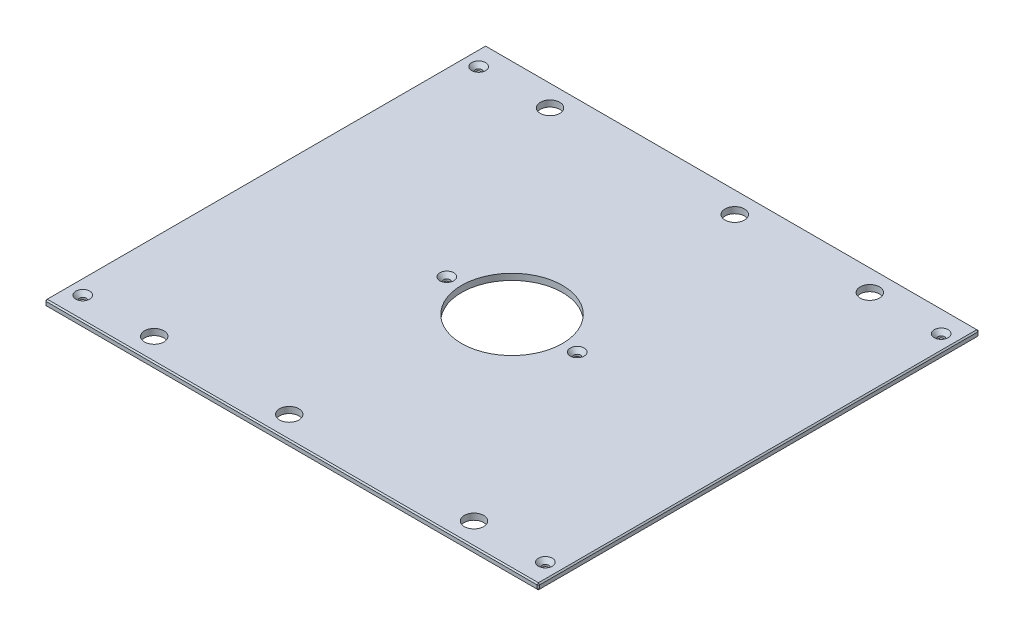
from build123d import *

# Parameters (mm, degrees)
SKETCH1_W                                     = 504.825
SKETCH1_H                                     = 450.85
BOSS_EXTRUDE1_DEPTH                           = 6.35
SKETCH13_R                                    = 51.562
CUT_EXTRUDE6_DEPTH                            = 339.480166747
F_25_32_0_78125_DIAMETER_HOLE1_D              = 19.84375
CHAMFER2_SIZE                                 = 1.27
CSK_FOR_1_4_FLAT_HEAD_MACHINE_SCREW1_AT_COUNT = 2
CSK_FOR_1_4_FLAT_HEAD_MACHINE_SCREW1_AT_PITCH = 404.80996
CSK_FOR_1_4_FLAT_HEAD_MACHINE_SCREW1_2_COUNT  = 2
CSK_FOR_1_4_FLAT_HEAD_MACHINE_SCREW1_2_PITCH  = 622.632362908
CSK_FOR_1_4_FLAT_HEAD_MACHINE_SCREW1_3_COUNT  = 2
CSK_FOR_1_4_FLAT_HEAD_MACHINE_SCREW1_3_PITCH  = 364.562197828
CSK_FOR_1_4_FLAT_HEAD_MACHINE_SCREW1_4_COUNT  = 2
CSK_FOR_1_4_FLAT_HEAD_MACHINE_SCREW1_4_PITCH  = 264.236721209
CSK_FOR_1_4_FLAT_HEAD_MACHINE_SCREW1_5_COUNT  = 2
CSK_FOR_1_4_FLAT_HEAD_MACHINE_SCREW1_5_PITCH  = 473.075
CSK_FOR_1_4_FLAT_HEAD_MACHINE_SCREW1_6_COUNT  = 2
CSK_FOR_1_4_FLAT_HEAD_MACHINE_SCREW1_6_PITCH  = 400.05
CSK_FOR_1_4_FLAT_HEAD_MACHINE_SCREW1_7_COUNT  = 2
CSK_FOR_1_4_FLAT_HEAD_MACHINE_SCREW1_7_PITCH  = 569.131888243


with BuildPart() as part:
    # Sketch1 → Boss-Extrude1 (new body)
    with BuildSketch(Plane(origin=(0, 0, 0), x_dir=(1, 0, 0), z_dir=(0, 1, 0))):
        Rectangle(SKETCH1_W, SKETCH1_H)
    extrude(amount=BOSS_EXTRUDE1_DEPTH)

    # Sketch13 → Cut-Extrude6 (cut, through all)
    with BuildSketch(Plane(origin=(0, 6.35, 0), x_dir=(1, 0, 0), z_dir=(0, 1, 0))):
        with Locations(Location((0, 0, 0), (0, 0, 270))):
            Circle(SKETCH13_R)
    extrude(amount=-CUT_EXTRUDE6_DEPTH, mode=Mode.SUBTRACT)

    # 25_32 _0.78125_ Diameter Hole1 (through all)
    with Locations(Plane(origin=(0, 6.35, 0), x_dir=(1, 0, 0), z_dir=(0, 1, 0))):
        with Locations((163.5125, 202.40498), (-163.5125, 202.40498), (163.5125, -202.40498), (-163.5125, -202.40498), (25.4, 202.40498), (-25.4, -202.40498)):
            Hole(F_25_32_0_78125_DIAMETER_HOLE1_D / 2)

    # Chamfer2
    chamfer2_edges = [part.edges().sort_by_distance(p)[0] for p in [
        (252.4125, 6.35, 0),
        (0, 6.35, -225.425),
        (-252.4125, 6.35, 0),
        (0, 0, -225.425),
        (252.4125, 0, 0),
        (0, 0, 225.425),
        (-252.4125, 0, 0),
        (0, 6.35, 225.425),
        (-252.4125, 3.175, -225.425),
        (252.4125, 3.175, -225.425),
        (252.4125, 3.175, 225.425),
        (-252.4125, 3.175, 225.425),
    ]]
    chamfer(chamfer2_edges, length=CHAMFER2_SIZE)

    # Sketch24 → CSK for 1_4 Flat Head Machine Screw1 (revolve, cut)
    with BuildSketch(Plane(origin=(236.5375, 6.35, -202.40498), x_dir=(0, 0, 1), z_dir=(1, 0, 0))):
        Polygon((0, 0), (0, 6.35), (3.3782, 6.35), (3.3782, 4.324464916), (7.1374, 0), align=None)
    csk_for_1_4_flat_head_machine_screw1 = revolve(axis=Axis((236.5375, 12.7, -202.40498), (0, -1, 0)), mode=Mode.SUBTRACT)

    # CSK for 1_4 Flat Head Machine Screw1 at: CSK for 1_4 Flat Head Machine Screw1 ×2
    with Locations(*[(0, 0, i * CSK_FOR_1_4_FLAT_HEAD_MACHINE_SCREW1_AT_PITCH) for i in range(1, CSK_FOR_1_4_FLAT_HEAD_MACHINE_SCREW1_AT_COUNT)]):
        add(csk_for_1_4_flat_head_machine_screw1, mode=Mode.SUBTRACT)

    # CSK for 1_4 Flat Head Machine Screw1 2: CSK for 1_4 Flat Head Machine Screw1 ×2
    with Locations(*[Vector(-0.7597982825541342, 0, 0.6501588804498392) * (i * CSK_FOR_1_4_FLAT_HEAD_MACHINE_SCREW1_2_PITCH) for i in range(1, CSK_FOR_1_4_FLAT_HEAD_MACHINE_SCREW1_2_COUNT)]):
        add(csk_for_1_4_flat_head_machine_screw1, mode=Mode.SUBTRACT)

    # CSK for 1_4 Flat Head Machine Screw1 3: CSK for 1_4 Flat Head Machine Screw1 ×2
    with Locations(*[Vector(-0.831716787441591, 0, 0.5552001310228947) * (i * CSK_FOR_1_4_FLAT_HEAD_MACHINE_SCREW1_3_PITCH) for i in range(1, CSK_FOR_1_4_FLAT_HEAD_MACHINE_SCREW1_3_COUNT)]):
        add(csk_for_1_4_flat_head_machine_screw1, mode=Mode.SUBTRACT)

    # CSK for 1_4 Flat Head Machine Screw1 4: CSK for 1_4 Flat Head Machine Screw1 ×2
    with Locations(*[Vector(-0.6428421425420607, 0, 0.7659986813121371) * (i * CSK_FOR_1_4_FLAT_HEAD_MACHINE_SCREW1_4_PITCH) for i in range(1, CSK_FOR_1_4_FLAT_HEAD_MACHINE_SCREW1_4_COUNT)]):
        add(csk_for_1_4_flat_head_machine_screw1, mode=Mode.SUBTRACT)

    # CSK for 1_4 Flat Head Machine Screw1 5: CSK for 1_4 Flat Head Machine Screw1 ×2
    with Locations(*[(-i * CSK_FOR_1_4_FLAT_HEAD_MACHINE_SCREW1_5_PITCH, 0, 0) for i in range(1, CSK_FOR_1_4_FLAT_HEAD_MACHINE_SCREW1_5_COUNT)]):
        add(csk_for_1_4_flat_head_machine_screw1, mode=Mode.SUBTRACT)

    # CSK for 1_4 Flat Head Machine Screw1 6: CSK for 1_4 Flat Head Machine Screw1 ×2
    with Locations(*[(-i * CSK_FOR_1_4_FLAT_HEAD_MACHINE_SCREW1_6_PITCH, 0, 0) for i in range(1, CSK_FOR_1_4_FLAT_HEAD_MACHINE_SCREW1_6_COUNT)]):
        add(csk_for_1_4_flat_head_machine_screw1, mode=Mode.SUBTRACT)

    # CSK for 1_4 Flat Head Machine Screw1 7: CSK for 1_4 Flat Head Machine Screw1 ×2
    with Locations(*[Vector(-0.7029126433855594, 0, 0.7112761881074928) * (i * CSK_FOR_1_4_FLAT_HEAD_MACHINE_SCREW1_7_PITCH) for i in range(1, CSK_FOR_1_4_FLAT_HEAD_MACHINE_SCREW1_7_COUNT)]):
        add(csk_for_1_4_flat_head_machine_screw1, mode=Mode.SUBTRACT)


solid = part.part
